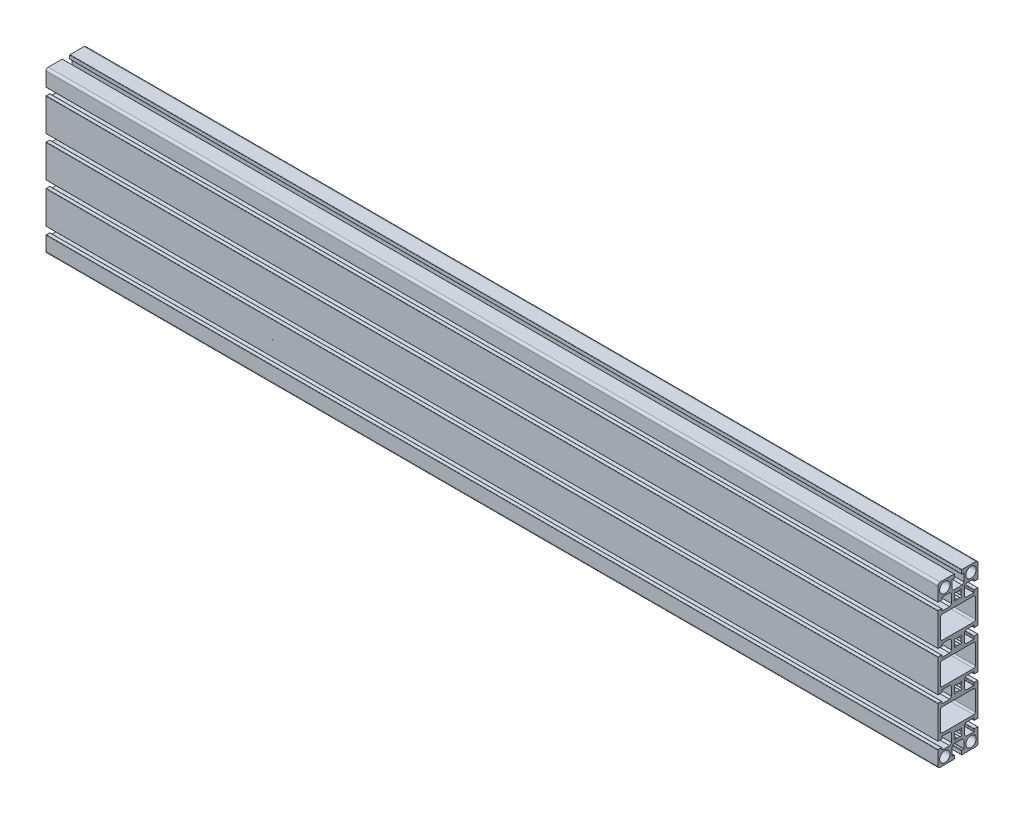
from build123d import *

# Parameters (mm, degrees)
MODEL13_R                        = 5.85000013
F_45_SARJA_1_0053_45X180_1_DEPTH = 1000


with BuildPart() as part:
    # Model13 → 45-sarja 1.0053 45X180_1 (new body)
    with BuildSketch(Plane(origin=(0, 0, 0), x_dir=(0, 0, -1), z_dir=(1, 0, 0))):
        with BuildLine():
            Line((18.499997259, -63.400001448), (22.199997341, -63.400001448))
            ThreePointArc((22.199997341, -63.400001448), (22.41213087, -63.312134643), (22.5, -63.100002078))
            Line((22.5, -63.100002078), (22.5, -26.899999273))
            ThreePointArc((22.5, -26.899999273), (22.412132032, -26.687867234), (22.199999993, -26.599999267))
            Line((22.199999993, -26.599999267), (18.499999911, -26.599999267))
            ThreePointArc((18.499999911, -26.599999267), (18.146446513, -26.746445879), (17.9999999, -27.099999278))
            Line((17.9999999, -27.099999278), (17.9999999, -29.00001932))
            ThreePointArc((17.9999999, -29.00001932), (17.912131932, -29.212151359), (17.699999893, -29.300019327))
            Line((17.699999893, -29.300019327), (9.200010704, -29.300019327))
            Line((9.200010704, -29.300019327), (7.20001066, -27.300019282))
            Line((7.20001066, -27.300019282), (7.20001066, -17.700013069))
            Line((7.20001066, -17.700013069), (9.200010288, -15.700012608))
            Line((9.200010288, -15.700012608), (17.699997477, -15.700012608))
            ThreePointArc((17.699997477, -15.700012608), (17.912129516, -15.787880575), (17.999997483, -16.000012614))
            Line((17.999997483, -16.000012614), (17.999997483, -17.900002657))
            ThreePointArc((17.999997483, -17.900002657), (18.146445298, -18.253553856), (18.499997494, -18.399999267))
            Line((18.499997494, -18.399999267), (22.199997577, -18.399999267))
            ThreePointArc((22.199997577, -18.399999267), (22.412129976, -18.312133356), (22.5, -18.100002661))
            Line((22.5, -18.100002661), (22.5, 18.100002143))
            ThreePointArc((22.5, 18.100002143), (22.412132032, 18.312134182), (22.199999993, 18.40000215))
            Line((22.199999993, 18.40000215), (18.499999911, 18.40000215))
            ThreePointArc((18.499999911, 18.40000215), (18.146446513, 18.253555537), (17.9999999, 17.900002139))
            Line((17.9999999, 17.900002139), (17.9999999, 15.999982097))
            ThreePointArc((17.9999999, 15.999982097), (17.912131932, 15.787850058), (17.699999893, 15.69998209))
            Line((17.699999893, 15.69998209), (9.200010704, 15.69998209))
            Line((9.200010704, 15.69998209), (7.20001066, 17.699982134))
            Line((7.20001066, 17.699982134), (7.20001066, 27.299988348))
            Line((7.20001066, 27.299988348), (9.200010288, 29.299988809))
            Line((9.200010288, 29.299988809), (17.699997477, 29.299988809))
            ThreePointArc((17.699997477, 29.299988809), (17.912129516, 29.212120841), (17.999997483, 28.999988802))
            Line((17.999997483, 28.999988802), (17.999997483, 27.09999876))
            ThreePointArc((17.999997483, 27.09999876), (18.146445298, 26.74644756), (18.499997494, 26.60000215))
            Line((18.499997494, 26.60000215), (22.199997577, 26.60000215))
            ThreePointArc((22.199997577, 26.60000215), (22.412129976, 26.687868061), (22.5, 26.899998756))
            Line((22.5, 26.899998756), (22.5, 63.09999556))
            ThreePointArc((22.5, 63.09999556), (22.412132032, 63.312127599), (22.199999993, 63.399995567))
            Line((22.199999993, 63.399995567), (18.499999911, 63.399995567))
            ThreePointArc((18.499999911, 63.399995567), (18.146446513, 63.253548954), (17.9999999, 62.899995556))
            Line((17.9999999, 62.899995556), (17.9999999, 60.999983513))
            ThreePointArc((17.9999999, 60.999983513), (17.912131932, 60.787851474), (17.699999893, 60.699983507))
            Line((17.699999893, 60.699983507), (9.200010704, 60.699983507))
            Line((9.200010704, 60.699983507), (7.20001066, 62.699983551))
            Line((7.20001066, 62.699983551), (7.20001066, 72.299989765))
            Line((7.20001066, 72.299989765), (9.200010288, 74.299990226))
            Line((9.200010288, 74.299990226), (17.699997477, 74.299990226))
            ThreePointArc((17.699997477, 74.299990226), (17.912129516, 74.212122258), (17.999997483, 73.999990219))
            Line((17.999997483, 73.999990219), (17.999997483, 72.100008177))
            ThreePointArc((17.999997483, 72.100008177), (18.146439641, 71.746446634), (18.499997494, 71.599995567))
            Line((18.499997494, 71.599995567), (22.199997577, 71.599995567))
            ThreePointArc((22.199997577, 71.599995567), (22.41213548, 71.687866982), (22.5, 71.900007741))
            Line((22.5, 71.900007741), (22.5, 87.500002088))
            ThreePointArc((22.5, 87.500002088), (21.767766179, 89.267767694), (19.999999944, 90))
            Line((19.999999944, 90), (4.399999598, 90))
            ThreePointArc((4.399999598, 90), (4.187868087, 89.912131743), (4.100000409, 89.699999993))
            Line((4.100000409, 89.699999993), (4.100000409, 85.999999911))
            ThreePointArc((4.100000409, 85.999999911), (4.246447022, 85.646446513), (4.60000042, 85.4999999))
            Line((4.60000042, 85.4999999), (6.500000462, 85.4999999))
            ThreePointArc((6.500000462, 85.4999999), (6.712131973, 85.412131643), (6.799999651, 85.199999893))
            Line((6.799999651, 85.199999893), (6.799999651, 76.699996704))
            Line((6.799999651, 76.699996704), (4.799999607, 74.69999666))
            Line((4.799999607, 74.69999666), (-4.799998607, 74.69999666))
            Line((-4.799998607, 74.69999666), (-6.799999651, 76.699996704))
            Line((-6.799999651, 76.699996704), (-6.799999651, 85.199999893))
            ThreePointArc((-6.799999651, 85.199999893), (-6.712131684, 85.412131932), (-6.499999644, 85.4999999))
            Line((-6.499999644, 85.4999999), (-4.599999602, 85.4999999))
            ThreePointArc((-4.599999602, 85.4999999), (-4.246446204, 85.646446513), (-4.099999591, 85.999999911))
            Line((-4.099999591, 85.999999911), (-4.099999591, 89.699999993))
            ThreePointArc((-4.099999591, 89.699999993), (-4.187867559, 89.912132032), (-4.399999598, 90))
            Line((-4.399999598, 90), (-19.999999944, 90))
            ThreePointArc((-19.999999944, 90), (-21.767766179, 89.267767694), (-22.5, 87.500002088))
            Line((-22.5, 87.500002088), (-22.5, 71.900007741))
            ThreePointArc((-22.5, 71.900007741), (-22.41213634, 71.687867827), (-22.199999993, 71.599995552))
            Line((-22.199999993, 71.599995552), (-18.499999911, 71.599995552))
            ThreePointArc((-18.499999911, 71.599995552), (-18.146446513, 71.746442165), (-17.9999999, 72.099995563))
            Line((-17.9999999, 72.099995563), (-17.9999999, 73.999992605))
            ThreePointArc((-17.9999999, 73.999992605), (-17.91213624, 74.21213252), (-17.699999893, 74.300004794))
            Line((-17.699999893, 74.300004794), (-9.199999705, 74.300004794))
            Line((-9.199999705, 74.300004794), (-7.19999966, 72.30000475))
            Line((-7.19999966, 72.30000475), (-7.19999966, 62.699998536))
            Line((-7.19999966, 62.699998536), (-9.199999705, 60.699998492))
            Line((-9.199999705, 60.699998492), (-17.699999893, 60.699998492))
            ThreePointArc((-17.699999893, 60.699998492), (-17.912131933, 60.78786646), (-17.9999999, 60.999998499))
            Line((-17.9999999, 60.999998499), (-17.9999999, 62.899995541))
            ThreePointArc((-17.9999999, 62.899995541), (-18.146446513, 63.253548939), (-18.499999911, 63.399995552))
            Line((-18.499999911, 63.399995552), (-22.199999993, 63.399995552))
            ThreePointArc((-22.199999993, 63.399995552), (-22.412132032, 63.312127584), (-22.5, 63.099995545))
            Line((-22.5, 63.099995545), (-22.5, 26.899998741))
            ThreePointArc((-22.5, 26.899998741), (-22.412130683, 26.68786917), (-22.199999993, 26.600002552))
            Line((-22.199999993, 26.600002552), (-18.499999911, 26.600002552))
            ThreePointArc((-18.499999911, 26.600002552), (-18.146446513, 26.746449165), (-17.9999999, 27.100002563))
            Line((-17.9999999, 27.100002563), (-17.9999999, 29.000007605))
            ThreePointArc((-17.9999999, 29.000007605), (-17.912130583, 29.212137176), (-17.699999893, 29.300003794))
            Line((-17.699999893, 29.300003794), (-9.199999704, 29.300003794))
            Line((-9.199999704, 29.300003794), (-7.19999966, 27.30000375))
            Line((-7.19999966, 27.30000375), (-7.19999966, 17.699997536))
            Line((-7.19999966, 17.699997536), (-9.199999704, 15.699997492))
            Line((-9.199999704, 15.699997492), (-17.699999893, 15.699997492))
            ThreePointArc((-17.699999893, 15.699997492), (-17.912131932, 15.78786546), (-17.9999999, 15.999997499))
            Line((-17.9999999, 15.999997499), (-17.9999999, 17.900002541))
            ThreePointArc((-17.9999999, 17.900002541), (-18.146446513, 18.253555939), (-18.499999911, 18.400002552))
            Line((-18.499999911, 18.400002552), (-22.199999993, 18.400002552))
            ThreePointArc((-22.199999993, 18.400002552), (-22.412132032, 18.312134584), (-22.5, 18.100002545))
            Line((-22.5, 18.100002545), (-22.5, -18.100002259))
            ThreePointArc((-22.5, -18.100002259), (-22.412130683, -18.31213183), (-22.199999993, -18.399998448))
            Line((-22.199999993, -18.399998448), (-18.499999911, -18.399998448))
            ThreePointArc((-18.499999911, -18.399998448), (-18.146446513, -18.253551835), (-17.9999999, -17.899998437))
            Line((-17.9999999, -17.899998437), (-17.9999999, -15.999993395))
            ThreePointArc((-17.9999999, -15.999993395), (-17.912130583, -15.787863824), (-17.699999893, -15.699997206))
            Line((-17.699999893, -15.699997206), (-9.199999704, -15.699997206))
            Line((-9.199999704, -15.699997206), (-7.19999966, -17.69999725))
            Line((-7.19999966, -17.69999725), (-7.19999966, -27.299999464))
            Line((-7.19999966, -27.299999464), (-9.199999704, -29.299999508))
            Line((-9.199999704, -29.299999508), (-17.699999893, -29.299999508))
            ThreePointArc((-17.699999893, -29.299999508), (-17.912131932, -29.21213154), (-17.9999999, -28.999999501))
            Line((-17.9999999, -28.999999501), (-17.9999999, -27.099998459))
            ThreePointArc((-17.9999999, -27.099998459), (-18.146446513, -26.746445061), (-18.499999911, -26.599998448))
            Line((-18.499999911, -26.599998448), (-22.199999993, -26.599998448))
            ThreePointArc((-22.199999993, -26.599998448), (-22.412132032, -26.687866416), (-22.5, -26.899998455))
            Line((-22.5, -26.899998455), (-22.5, -63.100001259))
            ThreePointArc((-22.5, -63.100001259), (-22.412132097, -63.312133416), (-22.199999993, -63.400001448))
            Line((-22.199999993, -63.400001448), (-18.499999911, -63.400001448))
            ThreePointArc((-18.499999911, -63.400001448), (-18.146446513, -63.253554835), (-17.9999999, -62.900001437))
            Line((-17.9999999, -62.900001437), (-17.9999999, -61.000002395))
            ThreePointArc((-17.9999999, -61.000002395), (-17.912131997, -60.787870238), (-17.699999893, -60.700002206))
            Line((-17.699999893, -60.700002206), (-9.199999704, -60.700002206))
            Line((-9.199999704, -60.700002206), (-7.19999966, -62.70000225))
            Line((-7.19999966, -62.70000225), (-7.19999966, -72.300000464))
            Line((-7.19999966, -72.300000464), (-9.199999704, -74.300001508))
            Line((-9.199999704, -74.300001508), (-17.699999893, -74.300001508))
            ThreePointArc((-17.699999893, -74.300001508), (-17.912131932, -74.21213354), (-17.9999999, -74.000001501))
            Line((-17.9999999, -74.000001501), (-17.9999999, -72.100001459))
            ThreePointArc((-17.9999999, -72.100001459), (-18.146446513, -71.746448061), (-18.499999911, -71.600001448))
            Line((-18.499999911, -71.600001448), (-22.199999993, -71.600001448))
            ThreePointArc((-22.199999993, -71.600001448), (-22.412132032, -71.687869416), (-22.5, -71.900001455))
            Line((-22.5, -71.900001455), (-22.5, -87.500001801))
            ThreePointArc((-22.5, -87.500001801), (-21.76776628, -89.267767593), (-19.999999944, -90))
            Line((-19.999999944, -90), (-4.399999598, -90))
            ThreePointArc((-4.399999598, -90), (-4.187867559, -89.912132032), (-4.099999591, -89.699999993))
            Line((-4.099999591, -89.699999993), (-4.099999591, -85.999999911))
            ThreePointArc((-4.099999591, -85.999999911), (-4.246446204, -85.646446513), (-4.599999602, -85.4999999))
            Line((-4.599999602, -85.4999999), (-6.499999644, -85.4999999))
            ThreePointArc((-6.499999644, -85.4999999), (-6.712131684, -85.412131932), (-6.799999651, -85.199999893))
            Line((-6.799999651, -85.199999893), (-6.799999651, -76.699999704))
            Line((-6.799999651, -76.699999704), (-4.799998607, -74.69999966))
            Line((-4.799998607, -74.69999966), (4.799999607, -74.69999966))
            Line((4.799999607, -74.69999966), (6.799999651, -76.699999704))
            Line((6.799999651, -76.699999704), (6.799999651, -85.199999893))
            ThreePointArc((6.799999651, -85.199999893), (6.712131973, -85.412131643), (6.500000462, -85.4999999))
            Line((6.500000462, -85.4999999), (4.60000042, -85.4999999))
            ThreePointArc((4.60000042, -85.4999999), (4.246447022, -85.646446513), (4.100000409, -85.999999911))
            Line((4.100000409, -85.999999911), (4.100000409, -89.699999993))
            ThreePointArc((4.100000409, -89.699999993), (4.187868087, -89.912131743), (4.399999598, -90))
            Line((4.399999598, -90), (19.999999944, -90))
            ThreePointArc((19.999999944, -90), (21.76776628, -89.267767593), (22.5, -87.500001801))
            Line((22.5, -87.500001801), (22.5, -71.900001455))
            ThreePointArc((22.5, -71.900001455), (22.412132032, -71.687869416), (22.199999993, -71.600001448))
            Line((22.199999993, -71.600001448), (18.499999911, -71.600001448))
            ThreePointArc((18.499999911, -71.600001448), (18.146446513, -71.746448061), (17.9999999, -72.100001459))
            Line((17.9999999, -72.100001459), (17.9999999, -74.000019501))
            ThreePointArc((17.9999999, -74.000019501), (17.91213192, -74.212151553), (17.699999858, -74.300019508))
            Line((17.699999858, -74.300019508), (9.200010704, -74.300019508))
            Line((9.200010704, -74.300019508), (7.200010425, -72.300020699))
            Line((7.200010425, -72.300020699), (7.200010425, -62.700014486))
            Line((7.200010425, -62.700014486), (9.200010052, -60.700014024))
            Line((9.200010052, -60.700014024), (17.699997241, -60.700014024))
            ThreePointArc((17.699997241, -60.700014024), (17.91212928, -60.787881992), (17.999997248, -61.000014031))
            Line((17.999997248, -61.000014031), (17.999997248, -62.900002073))
            ThreePointArc((17.999997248, -62.900002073), (18.146444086, -63.25355506), (18.499997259, -63.400001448))
        make_face()
        with Locations((14.65, 82.15)):
            Circle(MODEL13_R, mode=Mode.SUBTRACT)
        with Locations((-14.65, -82.15)):
            Circle(MODEL13_R, mode=Mode.SUBTRACT)
        with Locations((14.65, -82.15)):
            Circle(MODEL13_R, mode=Mode.SUBTRACT)
        with Locations((-14.65, 82.15)):
            Circle(MODEL13_R, mode=Mode.SUBTRACT)
        with BuildLine():
            Line((-3.048620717, 71.876003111), (-4.375996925, 70.548626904))
            Line((-4.375996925, 70.548626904), (-3.334501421, 69.5071314))
            ThreePointArc((-3.334501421, 69.5071314), (-3.250390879, 69.342331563), (-3.27896301, 69.159527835))
            ThreePointArc((-3.27896301, 69.159527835), (-3.675000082, 67.500003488), (-3.278964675, 65.840478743))
            ThreePointArc((-3.278964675, 65.840478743), (-3.250392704, 65.657675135), (-3.334503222, 65.492875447))
            Line((-3.334503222, 65.492875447), (-4.375996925, 64.451381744))
            Line((-4.375996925, 64.451381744), (-3.048620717, 63.124005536))
            Line((-3.048620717, 63.124005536), (-2.007127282, 64.165498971))
            ThreePointArc((-2.007127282, 64.165498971), (-1.842327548, 64.249609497), (-1.659523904, 64.221037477))
            ThreePointArc((-1.659523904, 64.221037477), (1.282e-06, 63.825001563), (1.659526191, 64.221038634))
            ThreePointArc((1.659526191, 64.221038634), (1.842329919, 64.249610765), (2.007129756, 64.165500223))
            Line((2.007129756, 64.165500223), (3.048624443, 63.124005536))
            Line((3.048624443, 63.124005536), (4.37600065, 64.451381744))
            Line((4.37600065, 64.451381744), (3.334504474, 65.49287792))
            ThreePointArc((3.334504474, 65.49287792), (3.250393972, 65.657677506), (3.278965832, 65.84048103))
            ThreePointArc((3.278965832, 65.84048103), (3.675000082, 67.500003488), (3.278964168, 69.159525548))
            ThreePointArc((3.278964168, 69.159525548), (3.250392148, 69.342329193), (3.334502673, 69.507128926))
            Line((3.334502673, 69.507128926), (4.37600065, 70.548626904))
            Line((4.37600065, 70.548626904), (3.048624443, 71.876003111))
            Line((3.048624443, 71.876003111), (2.007126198, 70.834504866))
            ThreePointArc((2.007126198, 70.834504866), (1.842326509, 70.750394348), (1.659522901, 70.778966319))
            ThreePointArc((1.659522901, 70.778966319), (1.282e-06, 71.175001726), (-1.659520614, 70.778967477))
            ThreePointArc((-1.659520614, 70.778967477), (-1.842324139, 70.750395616), (-2.007123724, 70.834506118))
            Line((-2.007123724, 70.834506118), (-3.048620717, 71.876003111))
        make_face(mode=Mode.SUBTRACT)
        with BuildLine():
            Line((-17.700001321, 32.300018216), (17.700001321, 32.300018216))
            ThreePointArc((17.700001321, 32.300018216), (18.972793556, 32.827226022), (19.500001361, 34.100018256))
            Line((19.500001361, 34.100018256), (19.500001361, 55.899982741))
            ThreePointArc((19.500001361, 55.899982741), (18.972793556, 57.172774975), (17.700001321, 57.699982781))
            Line((17.700001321, 57.699982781), (-17.700001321, 57.699982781))
            ThreePointArc((-17.700001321, 57.699982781), (-18.972793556, 57.172774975), (-19.500001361, 55.899982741))
            Line((-19.500001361, 55.899982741), (-19.500001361, 34.100018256))
            ThreePointArc((-19.500001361, 34.100018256), (-18.972793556, 32.827226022), (-17.700001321, 32.300018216))
        make_face(mode=Mode.SUBTRACT)
        with BuildLine():
            Line((-3.048620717, 26.876003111), (-4.375996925, 25.548626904))
            Line((-4.375996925, 25.548626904), (-3.334501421, 24.5071314))
            ThreePointArc((-3.334501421, 24.5071314), (-3.250390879, 24.342331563), (-3.27896301, 24.159527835))
            ThreePointArc((-3.27896301, 24.159527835), (-3.675000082, 22.500003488), (-3.278964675, 20.840478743))
            ThreePointArc((-3.278964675, 20.840478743), (-3.250392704, 20.657675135), (-3.334503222, 20.492875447))
            Line((-3.334503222, 20.492875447), (-4.375996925, 19.451381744))
            Line((-4.375996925, 19.451381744), (-3.048620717, 18.124005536))
            Line((-3.048620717, 18.124005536), (-2.007127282, 19.165498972))
            ThreePointArc((-2.007127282, 19.165498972), (-1.842327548, 19.249609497), (-1.659523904, 19.221037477))
            ThreePointArc((-1.659523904, 19.221037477), (1.282e-06, 18.825001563), (1.659526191, 19.221038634))
            ThreePointArc((1.659526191, 19.221038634), (1.842329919, 19.249610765), (2.007129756, 19.165500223))
            Line((2.007129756, 19.165500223), (3.048624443, 18.124005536))
            Line((3.048624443, 18.124005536), (4.37600065, 19.451381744))
            Line((4.37600065, 19.451381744), (3.334504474, 20.49287792))
            ThreePointArc((3.334504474, 20.49287792), (3.250393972, 20.657677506), (3.278965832, 20.84048103))
            ThreePointArc((3.278965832, 20.84048103), (3.675000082, 22.500003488), (3.278964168, 24.159525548))
            ThreePointArc((3.278964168, 24.159525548), (3.250392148, 24.342329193), (3.334502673, 24.507128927))
            Line((3.334502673, 24.507128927), (4.37600065, 25.548626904))
            Line((4.37600065, 25.548626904), (3.048624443, 26.876003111))
            Line((3.048624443, 26.876003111), (2.007126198, 25.834504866))
            ThreePointArc((2.007126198, 25.834504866), (1.842326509, 25.750394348), (1.659522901, 25.778966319))
            ThreePointArc((1.659522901, 25.778966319), (1.282e-06, 26.175001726), (-1.659520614, 25.778967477))
            ThreePointArc((-1.659520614, 25.778967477), (-1.842324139, 25.750395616), (-2.007123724, 25.834506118))
            Line((-2.007123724, 25.834506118), (-3.048620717, 26.876003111))
        make_face(mode=Mode.SUBTRACT)
        with BuildLine():
            Line((19.500001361, -10.899982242), (19.500001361, 10.899982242))
            ThreePointArc((19.500001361, 10.899982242), (18.972793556, 12.172774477), (17.700001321, 12.699982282))
            Line((17.700001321, 12.699982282), (-17.700001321, 12.699982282))
            ThreePointArc((-17.700001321, 12.699982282), (-18.972793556, 12.172774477), (-19.500001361, 10.899982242))
            Line((-19.500001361, 10.899982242), (-19.500001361, -10.899982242))
            ThreePointArc((-19.500001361, -10.899982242), (-18.972793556, -12.172774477), (-17.700001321, -12.699982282))
            Line((-17.700001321, -12.699982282), (17.700001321, -12.699982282))
            ThreePointArc((17.700001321, -12.699982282), (18.972793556, -12.172774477), (19.500001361, -10.899982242))
        make_face(mode=Mode.SUBTRACT)
        with BuildLine():
            Line((-3.048620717, -18.123998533), (-4.375996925, -19.45137474))
            Line((-4.375996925, -19.45137474), (-3.334501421, -20.492870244))
            ThreePointArc((-3.334501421, -20.492870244), (-3.250390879, -20.657670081), (-3.27896301, -20.840473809))
            ThreePointArc((-3.27896301, -20.840473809), (-3.675000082, -22.499998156), (-3.278964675, -24.159522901))
            ThreePointArc((-3.278964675, -24.159522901), (-3.250392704, -24.342326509), (-3.334503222, -24.507126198))
            Line((-3.334503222, -24.507126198), (-4.375996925, -25.5486199))
            Line((-4.375996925, -25.5486199), (-3.048620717, -26.875996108))
            Line((-3.048620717, -26.875996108), (-2.007127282, -25.834502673))
            ThreePointArc((-2.007127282, -25.834502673), (-1.842327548, -25.750392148), (-1.659523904, -25.778964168))
            ThreePointArc((-1.659523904, -25.778964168), (1.282e-06, -26.175000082), (1.659526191, -25.77896301))
            ThreePointArc((1.659526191, -25.77896301), (1.842329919, -25.750390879), (2.007129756, -25.834501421))
            Line((2.007129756, -25.834501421), (3.048624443, -26.875996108))
            Line((3.048624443, -26.875996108), (4.37600065, -25.5486199))
            Line((4.37600065, -25.5486199), (3.334504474, -24.507123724))
            ThreePointArc((3.334504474, -24.507123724), (3.250393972, -24.342324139), (3.278965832, -24.159520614))
            ThreePointArc((3.278965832, -24.159520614), (3.675000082, -22.499998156), (3.278964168, -20.840476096))
            ThreePointArc((3.278964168, -20.840476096), (3.250392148, -20.657672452), (3.334502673, -20.492872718))
            Line((3.334502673, -20.492872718), (4.37600065, -19.45137474))
            Line((4.37600065, -19.45137474), (3.048624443, -18.123998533))
            Line((3.048624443, -18.123998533), (2.007126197, -19.165496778))
            ThreePointArc((2.007126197, -19.165496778), (1.842326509, -19.249607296), (1.659522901, -19.221035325))
            ThreePointArc((1.659522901, -19.221035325), (1.282e-06, -18.824999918), (-1.659520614, -19.221034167))
            ThreePointArc((-1.659520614, -19.221034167), (-1.842324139, -19.249606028), (-2.007123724, -19.165495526))
            Line((-2.007123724, -19.165495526), (-3.048620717, -18.123998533))
        make_face(mode=Mode.SUBTRACT)
        with BuildLine():
            Line((19.500001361, -55.899983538), (19.500001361, -34.100019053))
            ThreePointArc((19.500001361, -34.100019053), (18.972793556, -32.827226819), (17.700001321, -32.300019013))
            Line((17.700001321, -32.300019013), (-17.700001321, -32.300019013))
            ThreePointArc((-17.700001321, -32.300019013), (-18.972793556, -32.827226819), (-19.500001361, -34.100019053))
            Line((-19.500001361, -34.100019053), (-19.500001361, -55.899983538))
            ThreePointArc((-19.500001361, -55.899983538), (-18.972793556, -57.172775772), (-17.700001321, -57.699983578))
            Line((-17.700001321, -57.699983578), (17.700001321, -57.699983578))
            ThreePointArc((17.700001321, -57.699983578), (18.972793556, -57.172775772), (19.500001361, -55.899983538))
        make_face(mode=Mode.SUBTRACT)
        with BuildLine():
            Line((-3.048620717, -63.123998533), (-4.375996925, -64.45137474))
            Line((-4.375996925, -64.45137474), (-3.334501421, -65.492870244))
            ThreePointArc((-3.334501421, -65.492870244), (-3.250390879, -65.657670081), (-3.27896301, -65.840473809))
            ThreePointArc((-3.27896301, -65.840473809), (-3.675000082, -67.499998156), (-3.278964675, -69.159522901))
            ThreePointArc((-3.278964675, -69.159522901), (-3.250392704, -69.342326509), (-3.334503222, -69.507126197))
            Line((-3.334503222, -69.507126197), (-4.375996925, -70.5486199))
            Line((-4.375996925, -70.5486199), (-3.048620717, -71.875996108))
            Line((-3.048620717, -71.875996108), (-2.007127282, -70.834502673))
            ThreePointArc((-2.007127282, -70.834502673), (-1.842327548, -70.750392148), (-1.659523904, -70.778964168))
            ThreePointArc((-1.659523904, -70.778964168), (1.282e-06, -71.175000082), (1.659526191, -70.77896301))
            ThreePointArc((1.659526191, -70.77896301), (1.842329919, -70.750390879), (2.007129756, -70.834501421))
            Line((2.007129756, -70.834501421), (3.048624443, -71.875996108))
            Line((3.048624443, -71.875996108), (4.37600065, -70.548619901))
            Line((4.37600065, -70.548619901), (3.334504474, -69.507123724))
            ThreePointArc((3.334504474, -69.507123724), (3.250393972, -69.342324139), (3.278965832, -69.159520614))
            ThreePointArc((3.278965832, -69.159520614), (3.675000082, -67.499998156), (3.278964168, -65.840476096))
            ThreePointArc((3.278964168, -65.840476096), (3.250392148, -65.657672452), (3.334502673, -65.492872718))
            Line((3.334502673, -65.492872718), (4.37600065, -64.45137474))
            Line((4.37600065, -64.45137474), (3.048624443, -63.123998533))
            Line((3.048624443, -63.123998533), (2.007126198, -64.165496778))
            ThreePointArc((2.007126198, -64.165496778), (1.842326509, -64.249607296), (1.659522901, -64.221035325))
            ThreePointArc((1.659522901, -64.221035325), (1.282e-06, -63.824999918), (-1.659520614, -64.221034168))
            ThreePointArc((-1.659520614, -64.221034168), (-1.842324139, -64.249606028), (-2.007123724, -64.165495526))
            Line((-2.007123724, -64.165495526), (-3.048620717, -63.123998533))
        make_face(mode=Mode.SUBTRACT)
    extrude(amount=F_45_SARJA_1_0053_45X180_1_DEPTH)


solid = part.part
